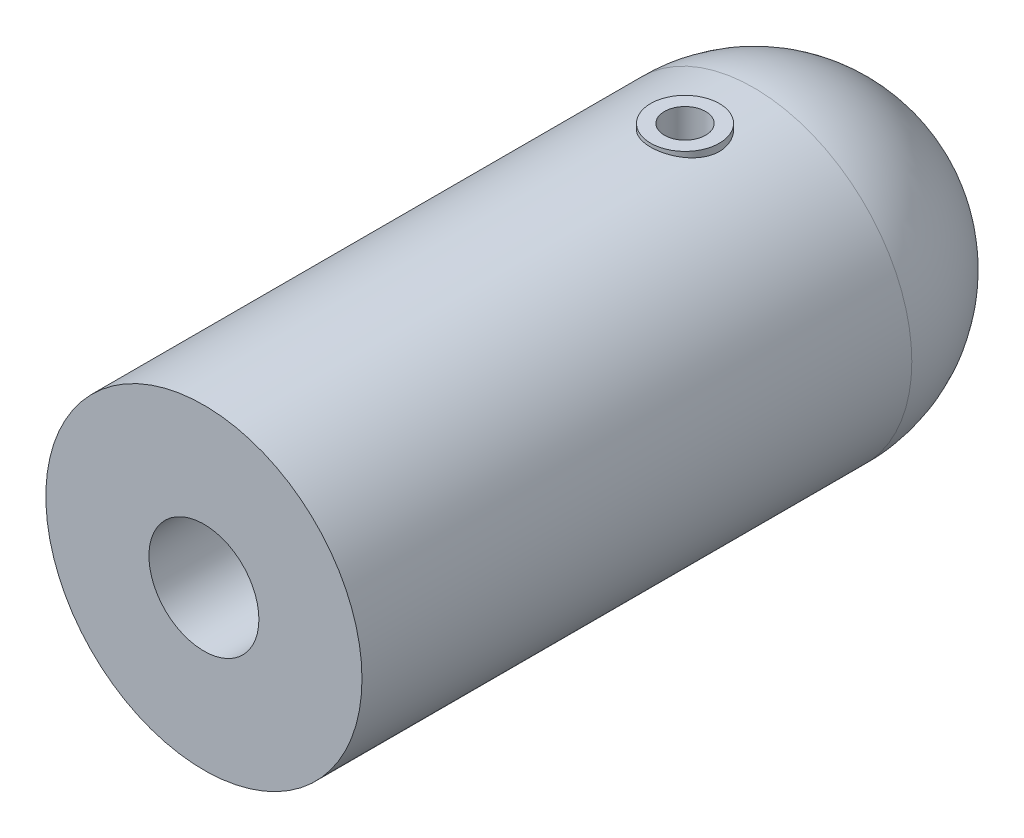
from build123d import *

# Parameters (mm, degrees)
ESQUISSE1_R             = 23
EXTRUSION1_DEPTH        = 80
ESQUISSE3_R             = 8
ENL_V_MAT_EXTRU_1_DEPTH = 90
EXTRUSION2_REACH        = 97.348
EXTRUSION2_END_RADIUS   = 23
ESQUISSE4_R             = 5
EXTRUSION3_REACH        = 97.593
EXTRUSION3_END_RADIUS   = 23
ESQUISSE5_R             = 5
ESQUISSE7_R             = 3
ENL_V_MAT_EXTRU_4_DEPTH = 10
ENL_V_START             = -10
ESQUISSE8_R             = 3
ENL_V_MAT_EXTRU_5_DEPTH = 10


with BuildPart() as part:
    # Esquisse1 → Extrusion1 (new body)
    with BuildSketch(Plane.XY):
        Circle(ESQUISSE1_R)
    extrude(amount=EXTRUSION1_DEPTH)

    # Esquisse3 → Enl_v. mat.-Extru.1 (cut)
    with BuildSketch(Plane.XY.offset(80)):
        Circle(ESQUISSE3_R)
    extrude(amount=-ENL_V_MAT_EXTRU_1_DEPTH, mode=Mode.SUBTRACT)

    # Extrusion2: up to this cylinder (the profile starts outside it)
    extrusion2_end = Plane(origin=(0, 0, 10), z_dir=(0, 0, -1)) * Cylinder(EXTRUSION2_END_RADIUS, 241.696, mode=Mode.PRIVATE)
    # Esquisse4 → Extrusion2 (add, up to the surface)
    with BuildSketch(Plane(origin=(0, 23.5, 0), x_dir=(-1, 0, 0), z_dir=(0, 1, 0)), mode=Mode.PRIVATE) as extrusion2_sk1:
        with Locations(Location((0, 10, 0), (0, 0, 90))):
            Circle(ESQUISSE4_R)
    extrusion2_tool1 = extrude(extrusion2_sk1.sketch, amount=-EXTRUSION2_REACH, mode=Mode.PRIVATE) - extrusion2_end
    add(extrusion2_tool1.solids().sort_by_distance((0, 23.5, 10))[0])

    # Extrusion3: up to this cylinder (the profile starts outside it)
    extrusion3_end = Plane(origin=(0, 0, 10), z_dir=(0, 0, -1)) * Cylinder(EXTRUSION3_END_RADIUS, 242.186, mode=Mode.PRIVATE)
    # Esquisse5 → Extrusion3 (add, up to the surface)
    with BuildSketch(Plane(origin=(0, -23.5, 0), x_dir=(-1, 0, 0), z_dir=(0, 1, 0)), mode=Mode.PRIVATE) as extrusion3_sk1:
        with Locations(Location((0, 10, 0), (0, 0, 90))):
            Circle(ESQUISSE5_R)
    extrusion3_tool1 = extrude(extrusion3_sk1.sketch, amount=EXTRUSION3_REACH, mode=Mode.PRIVATE) - extrusion3_end
    add(extrusion3_tool1.solids().sort_by_distance((0, -23.5, 10))[0])

    # Esquisse7 → Enl_v. mat.-Extru.4 (cut)
    with BuildSketch(Plane.XZ.offset(23.5)):
        with Locations(Location((0, 10, 0), (0, 0, 270))):
            Circle(ESQUISSE7_R)
    extrude(amount=-ENL_V_MAT_EXTRU_4_DEPTH, mode=Mode.SUBTRACT)

    # Esquisse8 → Enl_v. mat.-Extru.5 (cut)
    with BuildSketch(Plane(origin=(0, 23.5, 0), x_dir=(-1, 0, 0), z_dir=(0, 1, 0)).offset(ENL_V_START)):
        with Locations(Location((0, 10, 0), (0, 0, 270))):
            Circle(ESQUISSE8_R)
    extrude(amount=ENL_V_MAT_EXTRU_5_DEPTH, mode=Mode.SUBTRACT)

    # Esquisse9 → R_volution2 (revolve)
    with BuildSketch(Plane(origin=(0, 0, 0), x_dir=(1, 0, 0), z_dir=(0, 1, 0))):
        with BuildLine():
            Line((-23, 0), (0, 0))
            Line((0, 0), (0, 23.16972973))
            ThreePointArc((0, 23.16972973), (-16.298608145, 16.348320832), (-23, 0))
        make_face()
    revolve(axis=Axis((0, 0, 0), (0, 0, -1)))


solid = part.part
